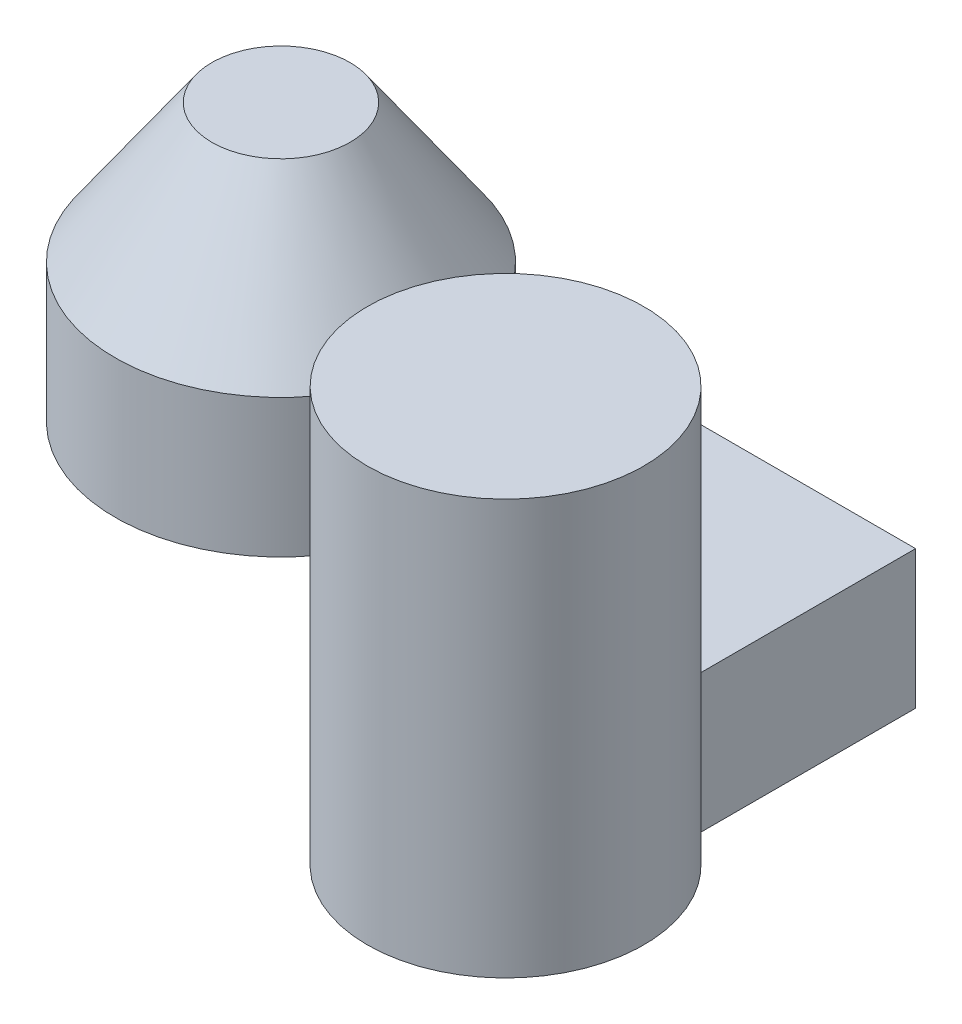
from build123d import *

# Parameters (mm, degrees)
BOSS_EXTRUDE1_DEPTH = 5
BOSS_EXTRUDE2_START = 10
SKETCH4_R           = 5
BOSS_EXTRUDE2_DEPTH = 10


with BuildPart() as part:
    # Sketch1 → Revolve1 (revolve)
    with BuildSketch(Plane(origin=(0, 0, 0), x_dir=(0, 0, -1), z_dir=(1, 0, 0))):
        Polygon((-6, 0), (-2.5, 5), (0, 5), (0, 0), align=None)
    revolve(axis=Axis((0, 5, 0), (0, -1, 0)))

    # Sketch2 → Boss-Extrude1 (add)
    with BuildSketch(Plane.XZ):
        with BuildLine():
            Line((5.454356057, 2.5), (15.454356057, 2.5))
            Line((15.454356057, 2.5), (15.454356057, 5.5))
            ThreePointArc((15.454356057, 5.5), (17.954356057, 14.830127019), (20.454356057, 5.5))
            Line((20.454356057, 5.5), (20.454356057, -2.5))
            Line((20.454356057, -2.5), (15.454356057, -2.5))
            Line((15.454356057, -2.5), (5.454356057, -2.5))
            ThreePointArc((5.454356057, -2.5), (-6, 0), (5.454356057, 2.5))
        make_face()
    extrude(amount=BOSS_EXTRUDE1_DEPTH)

    # Sketch4 → Boss-Extrude2 (add)
    with BuildSketch(Plane(origin=(0, 0, 0), x_dir=(1, 0, 0), z_dir=(0, 1, 0)).offset(BOSS_EXTRUDE2_START)):
        with Locations(Location((17.954356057, -9.830127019, 0), (0, 0, 270))):
            Circle(SKETCH4_R)
    extrude(amount=-BOSS_EXTRUDE2_DEPTH)


solid = part.part
